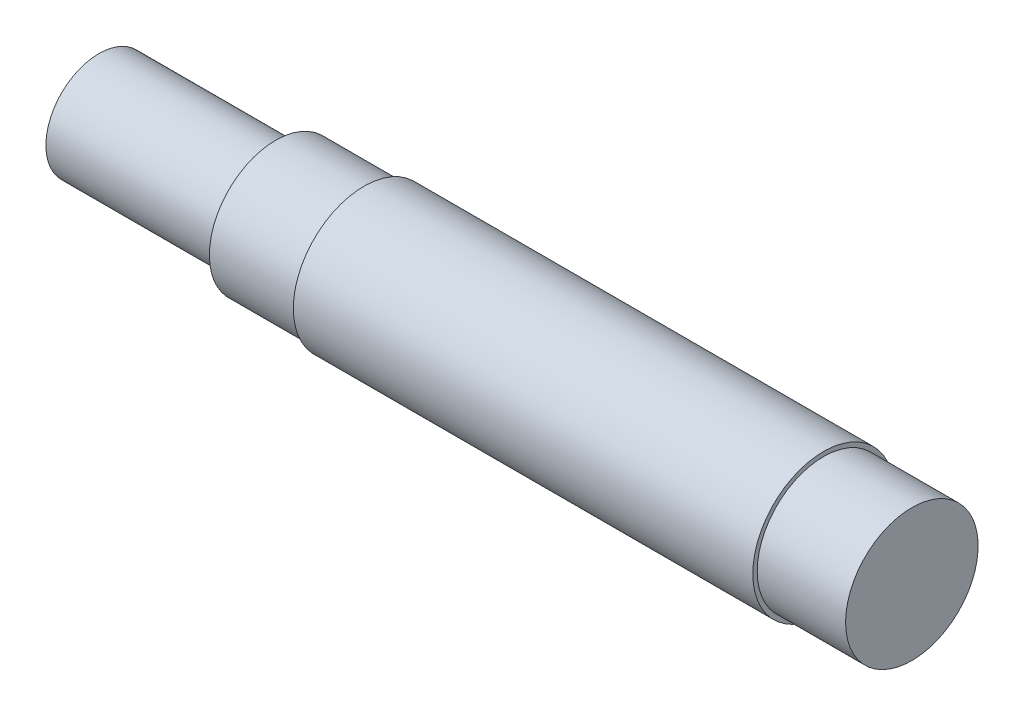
ISO-10303-21;
HEADER;
FILE_DESCRIPTION(('STEP AP214'),'2;1');
FILE_NAME('part.step','',(''),(''),'','','');
FILE_SCHEMA(('AUTOMOTIVE_DESIGN { 1 0 10303 214 1 1 1 1 }'));
ENDSEC;
DATA;
#1=APPLICATION_CONTEXT('core data for automotive mechanical design processes');
#2=APPLICATION_PROTOCOL_DEFINITION('international standard','automotive_design',2000,#1);
#3=PRODUCT_CONTEXT('',#1,'mechanical');
#4=PRODUCT('Part','Part','',(#3));
#5=PRODUCT_RELATED_PRODUCT_CATEGORY('part','',(#4));
#6=PRODUCT_DEFINITION_FORMATION('','',#4);
#7=PRODUCT_DEFINITION_CONTEXT('part definition',#1,'design');
#8=PRODUCT_DEFINITION('design','',#6,#7);
#9=PRODUCT_DEFINITION_SHAPE('','',#8);
#10=(LENGTH_UNIT() NAMED_UNIT(*) SI_UNIT(.MILLI.,.METRE.));
#11=(NAMED_UNIT(*) PLANE_ANGLE_UNIT() SI_UNIT($,.RADIAN.));
#12=(NAMED_UNIT(*) SI_UNIT($,.STERADIAN.) SOLID_ANGLE_UNIT());
#13=UNCERTAINTY_MEASURE_WITH_UNIT(LENGTH_MEASURE(1.E-05),#10,'distance_accuracy_value','');
#14=(GEOMETRIC_REPRESENTATION_CONTEXT(3) GLOBAL_UNCERTAINTY_ASSIGNED_CONTEXT((#13)) GLOBAL_UNIT_ASSIGNED_CONTEXT((#10,
#11,#12)) REPRESENTATION_CONTEXT('',''));
#15=CARTESIAN_POINT('',(0.,0.,0.));
#16=DIRECTION('',(0.,0.,1.));
#17=DIRECTION('',(1.,0.,0.));
#18=AXIS2_PLACEMENT_3D('',#15,#16,#17);
#19=CARTESIAN_POINT('',(-20.,0.,0.));
#20=DIRECTION('',(-1.,0.,0.));
#21=DIRECTION('',(0.,0.,1.));
#22=AXIS2_PLACEMENT_3D('',#19,#20,#21);
#23=PLANE('',#22);
#24=CARTESIAN_POINT('',(-20.,0.,0.));
#25=DIRECTION('',(1.,0.,0.));
#26=DIRECTION('',(0.,0.,-1.));
#27=AXIS2_PLACEMENT_3D('',#24,#25,#26);
#28=CIRCLE('',#27,6.);
#29=CARTESIAN_POINT('',(-20.,0.,-6.));
#30=VERTEX_POINT('',#29);
#31=EDGE_CURVE('E18',#30,#30,#28,.T.);
#32=ORIENTED_EDGE('',*,*,#31,.F.);
#33=EDGE_LOOP('',(#32));
#34=FACE_BOUND('',#33,.T.);
#35=ADVANCED_FACE('F15',(#34),#23,.T.);
#36=CARTESIAN_POINT('',(-20.,0.,0.));
#37=DIRECTION('',(1.,0.,0.));
#38=DIRECTION('',(0.,0.,-1.));
#39=AXIS2_PLACEMENT_3D('',#36,#37,#38);
#40=CYLINDRICAL_SURFACE('',#39,6.);
#41=ORIENTED_EDGE('',*,*,#31,.T.);
#42=EDGE_LOOP('',(#41));
#43=FACE_BOUND('',#42,.T.);
#44=CARTESIAN_POINT('',(0.,0.,0.));
#45=DIRECTION('',(1.,0.,0.));
#46=DIRECTION('',(0.,0.,-1.));
#47=AXIS2_PLACEMENT_3D('',#44,#45,#46);
#48=CIRCLE('',#47,6.);
#49=CARTESIAN_POINT('',(0.,0.,-6.));
#50=VERTEX_POINT('',#49);
#51=EDGE_CURVE('E40',#50,#50,#48,.F.);
#52=ORIENTED_EDGE('',*,*,#51,.T.);
#53=EDGE_LOOP('',(#52));
#54=FACE_BOUND('',#53,.T.);
#55=ADVANCED_FACE('F47',(#43,#54),#40,.T.);
#56=CARTESIAN_POINT('',(72.,0.,0.));
#57=DIRECTION('',(1.,0.,0.));
#58=DIRECTION('',(0.,0.,-1.));
#59=AXIS2_PLACEMENT_3D('',#56,#57,#58);
#60=PLANE('',#59);
#61=CARTESIAN_POINT('',(72.,0.,0.));
#62=DIRECTION('',(-1.,0.,0.));
#63=DIRECTION('',(0.,0.,1.));
#64=AXIS2_PLACEMENT_3D('',#61,#62,#63);
#65=CIRCLE('',#64,7.5);
#66=CARTESIAN_POINT('',(72.,0.,7.5));
#67=VERTEX_POINT('',#66);
#68=EDGE_CURVE('E38',#67,#67,#65,.T.);
#69=ORIENTED_EDGE('',*,*,#68,.F.);
#70=EDGE_LOOP('',(#69));
#71=FACE_BOUND('',#70,.T.);
#72=ADVANCED_FACE('F54',(#71),#60,.T.);
#73=CARTESIAN_POINT('',(0.,0.,0.));
#74=DIRECTION('',(1.,0.,0.));
#75=DIRECTION('',(0.,0.,-1.));
#76=AXIS2_PLACEMENT_3D('',#73,#74,#75);
#77=PLANE('',#76);
#78=ORIENTED_EDGE('',*,*,#51,.F.);
#79=EDGE_LOOP('',(#78));
#80=FACE_BOUND('',#79,.T.);
#81=CARTESIAN_POINT('',(0.,0.,0.));
#82=DIRECTION('',(-1.,0.,0.));
#83=DIRECTION('',(0.,0.,1.));
#84=AXIS2_PLACEMENT_3D('',#81,#82,#83);
#85=CIRCLE('',#84,7.5);
#86=CARTESIAN_POINT('',(0.,0.,7.5));
#87=VERTEX_POINT('',#86);
#88=EDGE_CURVE('E35',#87,#87,#85,.F.);
#89=ORIENTED_EDGE('',*,*,#88,.F.);
#90=EDGE_LOOP('',(#89));
#91=FACE_BOUND('',#90,.T.);
#92=ADVANCED_FACE('F77',(#80,#91),#77,.F.);
#93=CARTESIAN_POINT('',(72.,0.,0.));
#94=DIRECTION('',(-1.,0.,0.));
#95=DIRECTION('',(0.,0.,1.));
#96=AXIS2_PLACEMENT_3D('',#93,#94,#95);
#97=CYLINDRICAL_SURFACE('',#96,7.5);
#98=CARTESIAN_POINT('',(62.,0.,0.));
#99=DIRECTION('',(-1.,0.,0.));
#100=DIRECTION('',(0.,0.,1.));
#101=AXIS2_PLACEMENT_3D('',#98,#99,#100);
#102=CIRCLE('',#101,7.5);
#103=CARTESIAN_POINT('',(62.,0.,7.5));
#104=VERTEX_POINT('',#103);
#105=EDGE_CURVE('E32',#104,#104,#102,.T.);
#106=ORIENTED_EDGE('',*,*,#105,.F.);
#107=EDGE_LOOP('',(#106));
#108=FACE_BOUND('',#107,.T.);
#109=ORIENTED_EDGE('',*,*,#68,.T.);
#110=EDGE_LOOP('',(#109));
#111=FACE_BOUND('',#110,.T.);
#112=ADVANCED_FACE('F73',(#108,#111),#97,.T.);
#113=CARTESIAN_POINT('',(10.,0.,0.));
#114=DIRECTION('',(-1.,0.,0.));
#115=DIRECTION('',(0.,0.,1.));
#116=AXIS2_PLACEMENT_3D('',#113,#114,#115);
#117=CYLINDRICAL_SURFACE('',#116,7.5);
#118=CARTESIAN_POINT('',(10.,0.,0.));
#119=DIRECTION('',(-1.,0.,0.));
#120=DIRECTION('',(0.,0.,1.));
#121=AXIS2_PLACEMENT_3D('',#118,#119,#120);
#122=CIRCLE('',#121,7.5);
#123=CARTESIAN_POINT('',(10.,0.,7.5));
#124=VERTEX_POINT('',#123);
#125=EDGE_CURVE('E27',#124,#124,#122,.T.);
#126=ORIENTED_EDGE('',*,*,#125,.T.);
#127=EDGE_LOOP('',(#126));
#128=FACE_BOUND('',#127,.T.);
#129=ORIENTED_EDGE('',*,*,#88,.T.);
#130=EDGE_LOOP('',(#129));
#131=FACE_BOUND('',#130,.T.);
#132=ADVANCED_FACE('F69',(#128,#131),#117,.T.);
#133=CARTESIAN_POINT('',(62.,0.,0.));
#134=DIRECTION('',(1.,0.,0.));
#135=DIRECTION('',(0.,0.,-1.));
#136=AXIS2_PLACEMENT_3D('',#133,#134,#135);
#137=PLANE('',#136);
#138=ORIENTED_EDGE('',*,*,#105,.T.);
#139=EDGE_LOOP('',(#138));
#140=FACE_BOUND('',#139,.T.);
#141=CARTESIAN_POINT('',(62.,0.,0.));
#142=DIRECTION('',(-1.,0.,0.));
#143=DIRECTION('',(0.,0.,1.));
#144=AXIS2_PLACEMENT_3D('',#141,#142,#143);
#145=CIRCLE('',#144,8.);
#146=CARTESIAN_POINT('',(62.,0.,8.));
#147=VERTEX_POINT('',#146);
#148=EDGE_CURVE('E22',#147,#147,#145,.T.);
#149=ORIENTED_EDGE('',*,*,#148,.F.);
#150=EDGE_LOOP('',(#149));
#151=FACE_BOUND('',#150,.T.);
#152=ADVANCED_FACE('F62',(#140,#151),#137,.T.);
#153=CARTESIAN_POINT('',(10.,0.,0.));
#154=DIRECTION('',(1.,0.,0.));
#155=DIRECTION('',(0.,0.,-1.));
#156=AXIS2_PLACEMENT_3D('',#153,#154,#155);
#157=PLANE('',#156);
#158=ORIENTED_EDGE('',*,*,#125,.F.);
#159=EDGE_LOOP('',(#158));
#160=FACE_BOUND('',#159,.T.);
#161=CARTESIAN_POINT('',(10.,0.,0.));
#162=DIRECTION('',(-1.,0.,0.));
#163=DIRECTION('',(0.,0.,1.));
#164=AXIS2_PLACEMENT_3D('',#161,#162,#163);
#165=CIRCLE('',#164,8.);
#166=CARTESIAN_POINT('',(10.,0.,8.));
#167=VERTEX_POINT('',#166);
#168=EDGE_CURVE('E10',#167,#167,#165,.F.);
#169=ORIENTED_EDGE('',*,*,#168,.F.);
#170=EDGE_LOOP('',(#169));
#171=FACE_BOUND('',#170,.T.);
#172=ADVANCED_FACE('F57',(#160,#171),#157,.F.);
#173=CARTESIAN_POINT('',(62.,0.,0.));
#174=DIRECTION('',(-1.,0.,0.));
#175=DIRECTION('',(0.,0.,1.));
#176=AXIS2_PLACEMENT_3D('',#173,#174,#175);
#177=CYLINDRICAL_SURFACE('',#176,8.);
#178=ORIENTED_EDGE('',*,*,#168,.T.);
#179=EDGE_LOOP('',(#178));
#180=FACE_BOUND('',#179,.T.);
#181=ORIENTED_EDGE('',*,*,#148,.T.);
#182=EDGE_LOOP('',(#181));
#183=FACE_BOUND('',#182,.T.);
#184=ADVANCED_FACE('F55',(#180,#183),#177,.T.);
#185=CLOSED_SHELL('',(#35,#55,#72,#92,#112,#132,#152,#172,#184));
#186=MANIFOLD_SOLID_BREP('B1',#185);
#187=ADVANCED_BREP_SHAPE_REPRESENTATION('',(#18,#186),#14);
#188=SHAPE_DEFINITION_REPRESENTATION(#9,#187);
ENDSEC;
END-ISO-10303-21;
